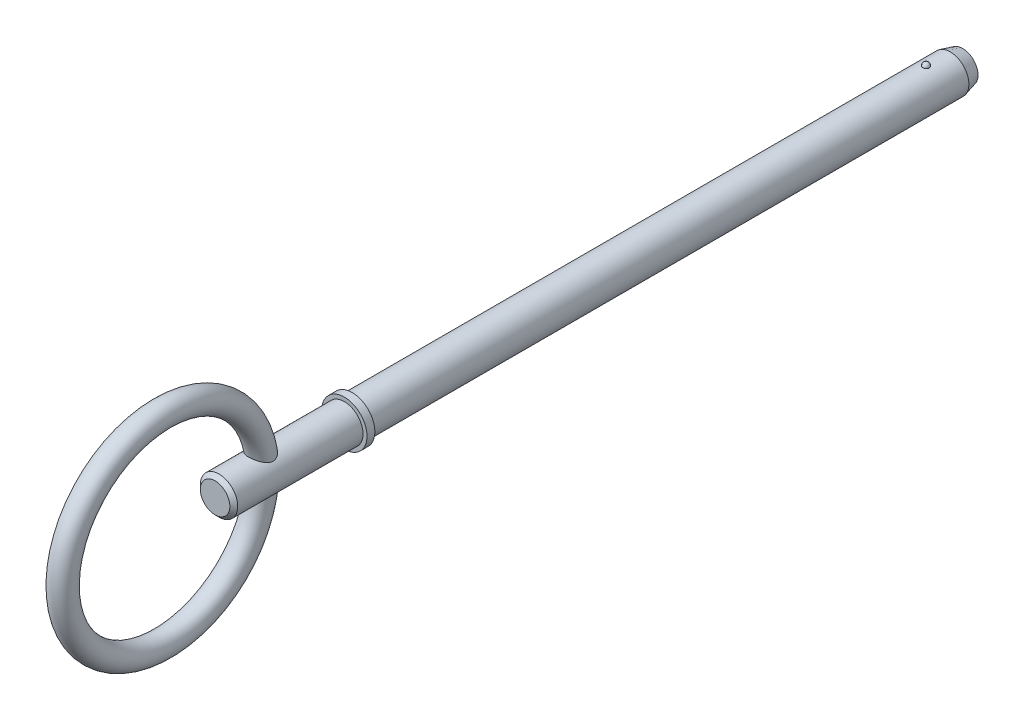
from build123d import *

# Parameters (mm, degrees)
SKETCH2_R           = 2.38
BOSS_EXTRUDE1_DEPTH = 72.6
BOSS_EXTRUDE2_START = 5.08
SKETCH3_R           = 2.38
BOSS_EXTRUDE2_DEPTH = 5.08
CHAMFER1_SIZE       = 1.586
CHAMFER1_SIZE2      = 0.424967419
SKETCH20_W          = 1
SKETCH20_H          = 2.88
SKETCH21_R          = 2.38
BOSS_EXTRUDE3_DEPTH = 17.45
CHAMFER2_SIZE       = 0.5
SKETCH24_R          = 1.5


with BuildPart() as part:
    # Sketch2 → Boss-Extrude1 (new body)
    with BuildSketch(Plane.XY):
        Circle(SKETCH2_R)
    extrude(amount=BOSS_EXTRUDE1_DEPTH)

    # Sketch3 → Boss-Extrude2 (add)
    with BuildSketch(Plane(origin=(0, 0, 0), x_dir=(-1, 0, 0), z_dir=(0, 0, -1)).offset(BOSS_EXTRUDE2_START)):
        Circle(SKETCH3_R)
    extrude(amount=-BOSS_EXTRUDE2_DEPTH)

    # Chamfer1
    chamfer1_edges = [part.edges().sort_by_distance(p)[0] for p in [
        (2.38, 0, -5.08),
    ]]
    chamfer1_side = [part.faces().sort_by_distance(p)[0] for p in [
        (2.38, 0, -2.54),
    ]]
    chamfer(chamfer1_edges, length=CHAMFER1_SIZE, length2=CHAMFER1_SIZE2, reference=chamfer1_side[0])

    # Sketch18 → Revolve1 (revolve)
    with BuildSketch(Plane(origin=(0, 0, 0), x_dir=(0, 0, -1), z_dir=(1, 0, 0))):
        with BuildLine():
            Line((0.42, 2.8), (0.42, 1.96))
            ThreePointArc((0.42, 1.96), (0, 2.38), (0.42, 2.8))
        make_face()
    revolve(axis=Axis((0, 2.8, -0.42), (0, -1, 0)))

    # Sketch20 → Revolve2 (revolve)
    with BuildSketch(Plane(origin=(0, 0, 0), x_dir=(0, 0, -1), z_dir=(1, 0, 0)), mode=Mode.PRIVATE) as revolve2_sk:
        with Locations((-73.1, 1.44)):
            Rectangle(SKETCH20_W, SKETCH20_H)
    revolve(revolve2_sk.sketch.rotate(Axis((0, 0, 33.728787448), (0, 0, 1)), 90), axis=Axis((0, 0, 33.728787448), (0, 0, 1)))

    # Sketch21 → Boss-Extrude3 (add)
    with BuildSketch(Plane(origin=(0, 0, 72.6), x_dir=(-1, 0, 0), z_dir=(0, 0, -1))):
        Circle(SKETCH21_R)
    extrude(amount=-BOSS_EXTRUDE3_DEPTH)

    # Chamfer2
    chamfer2_edges = [part.edges().sort_by_distance(p)[0] for p in [
        (2.38, 0, 90.05),
    ]]
    chamfer(chamfer2_edges, length=CHAMFER2_SIZE)

    # Sweep1: sweep along a path in Sketch23
    with BuildLine(Plane(origin=(0, 0, 0), x_dir=(0, 0, -1), z_dir=(1, 0, 0))) as sweep1_path:
        CenterArc((-96.75, 0), 12.7, 0, 360)
    # Sketch24 → Sweep1 (sweep)
    with BuildSketch(Plane(origin=(0, 0, 0), x_dir=(1, 0, 0), z_dir=(0, 1, 0))):
        with Locations((0, -84.05)):
            Circle(SKETCH24_R)
    sweep(path=sweep1_path.line)


solid = part.part
